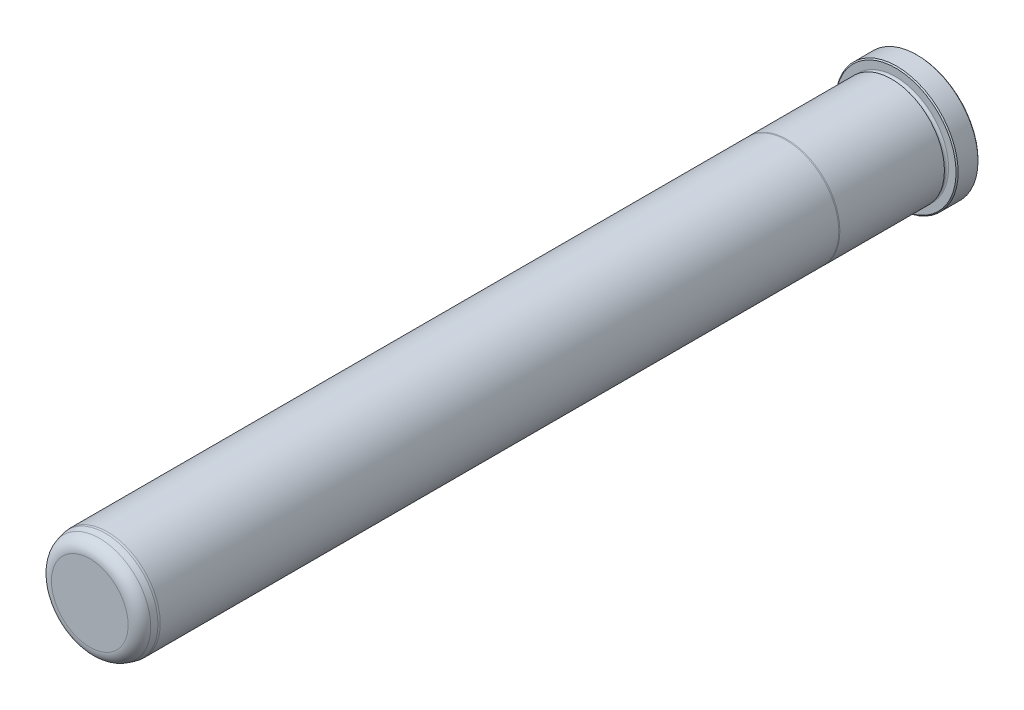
ISO-10303-21;
HEADER;
FILE_DESCRIPTION(('STEP AP214'),'2;1');
FILE_NAME('part.step','',(''),(''),'','','');
FILE_SCHEMA(('AUTOMOTIVE_DESIGN { 1 0 10303 214 1 1 1 1 }'));
ENDSEC;
DATA;
#1=APPLICATION_CONTEXT('core data for automotive mechanical design processes');
#2=APPLICATION_PROTOCOL_DEFINITION('international standard','automotive_design',2000,#1);
#3=PRODUCT_CONTEXT('',#1,'mechanical');
#4=PRODUCT('Part','Part','',(#3));
#5=PRODUCT_RELATED_PRODUCT_CATEGORY('part','',(#4));
#6=PRODUCT_DEFINITION_FORMATION('','',#4);
#7=PRODUCT_DEFINITION_CONTEXT('part definition',#1,'design');
#8=PRODUCT_DEFINITION('design','',#6,#7);
#9=PRODUCT_DEFINITION_SHAPE('','',#8);
#10=(LENGTH_UNIT() NAMED_UNIT(*) SI_UNIT(.MILLI.,.METRE.));
#11=(NAMED_UNIT(*) PLANE_ANGLE_UNIT() SI_UNIT($,.RADIAN.));
#12=(NAMED_UNIT(*) SI_UNIT($,.STERADIAN.) SOLID_ANGLE_UNIT());
#13=UNCERTAINTY_MEASURE_WITH_UNIT(LENGTH_MEASURE(1.E-05),#10,'distance_accuracy_value','');
#14=(GEOMETRIC_REPRESENTATION_CONTEXT(3) GLOBAL_UNCERTAINTY_ASSIGNED_CONTEXT((#13)) GLOBAL_UNIT_ASSIGNED_CONTEXT((#10,
#11,#12)) REPRESENTATION_CONTEXT('',''));
#15=CARTESIAN_POINT('',(0.,0.,0.));
#16=DIRECTION('',(0.,0.,1.));
#17=DIRECTION('',(1.,0.,0.));
#18=AXIS2_PLACEMENT_3D('',#15,#16,#17);
#19=CARTESIAN_POINT('',(0.,0.,0.));
#20=DIRECTION('',(0.,0.,1.));
#21=DIRECTION('',(1.,0.,0.));
#22=AXIS2_PLACEMENT_3D('',#19,#20,#21);
#23=PLANE('',#22);
#24=CARTESIAN_POINT('',(0.,0.,0.));
#25=DIRECTION('',(0.,0.,1.));
#26=DIRECTION('',(1.,0.,0.));
#27=AXIS2_PLACEMENT_3D('',#24,#25,#26);
#28=CIRCLE('',#27,21.717);
#29=CARTESIAN_POINT('',(21.717,0.,0.));
#30=VERTEX_POINT('',#29);
#31=EDGE_CURVE('E37',#30,#30,#28,.F.);
#32=ORIENTED_EDGE('',*,*,#31,.T.);
#33=EDGE_LOOP('',(#32));
#34=FACE_BOUND('',#33,.T.);
#35=ADVANCED_FACE('F30',(#34),#23,.F.);
#36=CARTESIAN_POINT('',(0.,0.,0.));
#37=DIRECTION('',(0.,0.,1.));
#38=DIRECTION('',(1.,0.,0.));
#39=AXIS2_PLACEMENT_3D('',#36,#37,#38);
#40=CYLINDRICAL_SURFACE('',#39,22.098);
#41=CARTESIAN_POINT('',(0.,0.,0.380999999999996));
#42=DIRECTION('',(0.,0.,1.));
#43=DIRECTION('',(1.,0.,0.));
#44=AXIS2_PLACEMENT_3D('',#41,#42,#43);
#45=CIRCLE('',#44,22.098);
#46=CARTESIAN_POINT('',(22.098,0.,0.380999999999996));
#47=VERTEX_POINT('',#46);
#48=EDGE_CURVE('E41',#47,#47,#45,.T.);
#49=ORIENTED_EDGE('',*,*,#48,.T.);
#50=EDGE_LOOP('',(#49));
#51=FACE_BOUND('',#50,.T.);
#52=CARTESIAN_POINT('',(0.,0.,7.54379999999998));
#53=DIRECTION('',(0.,0.,-1.));
#54=DIRECTION('',(-1.,0.,0.));
#55=AXIS2_PLACEMENT_3D('',#52,#53,#54);
#56=CIRCLE('',#55,22.098);
#57=CARTESIAN_POINT('',(-22.098,0.,7.54379999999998));
#58=VERTEX_POINT('',#57);
#59=EDGE_CURVE('E45',#58,#58,#56,.T.);
#60=ORIENTED_EDGE('',*,*,#59,.T.);
#61=EDGE_LOOP('',(#60));
#62=FACE_BOUND('',#61,.T.);
#63=ADVANCED_FACE('F118',(#51,#62),#40,.T.);
#64=CARTESIAN_POINT('',(0.,22.098,7.9248));
#65=DIRECTION('',(0.,0.,-1.));
#66=DIRECTION('',(-1.,0.,0.));
#67=AXIS2_PLACEMENT_3D('',#64,#65,#66);
#68=PLANE('',#67);
#69=CARTESIAN_POINT('',(0.,0.,7.9248));
#70=DIRECTION('',(0.,0.,-1.));
#71=DIRECTION('',(-1.,0.,0.));
#72=AXIS2_PLACEMENT_3D('',#69,#70,#71);
#73=CIRCLE('',#72,21.717);
#74=CARTESIAN_POINT('',(-21.717,0.,7.9248));
#75=VERTEX_POINT('',#74);
#76=EDGE_CURVE('E10',#75,#75,#73,.F.);
#77=ORIENTED_EDGE('',*,*,#76,.T.);
#78=EDGE_LOOP('',(#77));
#79=FACE_BOUND('',#78,.T.);
#80=CARTESIAN_POINT('',(0.,0.,7.9248));
#81=DIRECTION('',(0.,0.,1.));
#82=DIRECTION('',(1.,0.,0.));
#83=AXIS2_PLACEMENT_3D('',#80,#81,#82);
#84=CIRCLE('',#83,19.0373);
#85=CARTESIAN_POINT('',(19.0373,0.,7.9248));
#86=VERTEX_POINT('',#85);
#87=EDGE_CURVE('E56',#86,#86,#84,.T.);
#88=ORIENTED_EDGE('',*,*,#87,.F.);
#89=EDGE_LOOP('',(#88));
#90=FACE_BOUND('',#89,.T.);
#91=ADVANCED_FACE('F113',(#79,#90),#68,.F.);
#92=CARTESIAN_POINT('',(0.,0.,8.6868));
#93=DIRECTION('',(0.,0.,1.));
#94=DIRECTION('',(1.,0.,0.));
#95=AXIS2_PLACEMENT_3D('',#92,#93,#94);
#96=TOROIDAL_SURFACE('',#95,19.0373,0.762);
#97=CARTESIAN_POINT('',(0.,0.,9.4488));
#98=DIRECTION('',(0.,0.,1.));
#99=DIRECTION('',(1.,0.,0.));
#100=AXIS2_PLACEMENT_3D('',#97,#98,#99);
#101=CIRCLE('',#100,19.0373);
#102=CARTESIAN_POINT('',(19.0373,0.,9.4488));
#103=VERTEX_POINT('',#102);
#104=EDGE_CURVE('E59',#103,#103,#101,.T.);
#105=ORIENTED_EDGE('',*,*,#104,.F.);
#106=EDGE_LOOP('',(#105));
#107=FACE_BOUND('',#106,.T.);
#108=ORIENTED_EDGE('',*,*,#87,.T.);
#109=EDGE_LOOP('',(#108));
#110=FACE_BOUND('',#109,.T.);
#111=ADVANCED_FACE('F107',(#107,#110),#96,.F.);
#112=CARTESIAN_POINT('',(0.,19.0373,9.4488));
#113=DIRECTION('',(0.,0.,1.));
#114=DIRECTION('',(1.,0.,0.));
#115=AXIS2_PLACEMENT_3D('',#112,#113,#114);
#116=PLANE('',#115);
#117=CARTESIAN_POINT('',(0.,0.,9.4488));
#118=DIRECTION('',(0.,0.,1.));
#119=DIRECTION('',(1.,0.,0.));
#120=AXIS2_PLACEMENT_3D('',#117,#118,#119);
#121=CIRCLE('',#120,19.0627);
#122=CARTESIAN_POINT('',(19.0627,0.,9.4488));
#123=VERTEX_POINT('',#122);
#124=EDGE_CURVE('E62',#123,#123,#121,.T.);
#125=ORIENTED_EDGE('',*,*,#124,.F.);
#126=EDGE_LOOP('',(#125));
#127=FACE_BOUND('',#126,.T.);
#128=ORIENTED_EDGE('',*,*,#104,.T.);
#129=EDGE_LOOP('',(#128));
#130=FACE_BOUND('',#129,.T.);
#131=ADVANCED_FACE('F101',(#127,#130),#116,.F.);
#132=CARTESIAN_POINT('',(0.,0.,0.));
#133=DIRECTION('',(0.,0.,1.));
#134=DIRECTION('',(1.,0.,0.));
#135=AXIS2_PLACEMENT_3D('',#132,#133,#134);
#136=CYLINDRICAL_SURFACE('',#135,19.0627);
#137=CARTESIAN_POINT('',(0.,0.,47.1347630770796));
#138=DIRECTION('',(0.,0.,1.));
#139=DIRECTION('',(1.,0.,0.));
#140=AXIS2_PLACEMENT_3D('',#137,#138,#139);
#141=CIRCLE('',#140,19.0627);
#142=CARTESIAN_POINT('',(19.0627,0.,47.1347630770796));
#143=VERTEX_POINT('',#142);
#144=EDGE_CURVE('E65',#143,#143,#141,.T.);
#145=ORIENTED_EDGE('',*,*,#144,.F.);
#146=EDGE_LOOP('',(#145));
#147=FACE_BOUND('',#146,.T.);
#148=ORIENTED_EDGE('',*,*,#124,.T.);
#149=EDGE_LOOP('',(#148));
#150=FACE_BOUND('',#149,.T.);
#151=ADVANCED_FACE('F95',(#147,#150),#136,.T.);
#152=CARTESIAN_POINT('',(0.,0.,47.1347630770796));
#153=DIRECTION('',(0.,0.,-1.));
#154=DIRECTION('',(-1.,0.,0.));
#155=AXIS2_PLACEMENT_3D('',#152,#153,#154);
#156=CONICAL_SURFACE('',#155,19.0627,0.0698131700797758);
#157=CARTESIAN_POINT('',(0.,0.,47.498));
#158=DIRECTION('',(0.,0.,1.));
#159=DIRECTION('',(1.,0.,0.));
#160=AXIS2_PLACEMENT_3D('',#157,#158,#159);
#161=CIRCLE('',#160,19.0373);
#162=CARTESIAN_POINT('',(19.0373,0.,47.498));
#163=VERTEX_POINT('',#162);
#164=EDGE_CURVE('E68',#163,#163,#161,.T.);
#165=ORIENTED_EDGE('',*,*,#164,.F.);
#166=EDGE_LOOP('',(#165));
#167=FACE_BOUND('',#166,.T.);
#168=ORIENTED_EDGE('',*,*,#144,.T.);
#169=EDGE_LOOP('',(#168));
#170=FACE_BOUND('',#169,.T.);
#171=ADVANCED_FACE('F89',(#167,#170),#156,.T.);
#172=CARTESIAN_POINT('',(0.,0.,0.));
#173=DIRECTION('',(0.,0.,1.));
#174=DIRECTION('',(1.,0.,0.));
#175=AXIS2_PLACEMENT_3D('',#172,#173,#174);
#176=CYLINDRICAL_SURFACE('',#175,19.0373);
#177=CARTESIAN_POINT('',(0.,0.,292.1));
#178=DIRECTION('',(0.,0.,1.));
#179=DIRECTION('',(1.,0.,0.));
#180=AXIS2_PLACEMENT_3D('',#177,#178,#179);
#181=CIRCLE('',#180,19.0373);
#182=CARTESIAN_POINT('',(19.0373,0.,292.1));
#183=VERTEX_POINT('',#182);
#184=EDGE_CURVE('E71',#183,#183,#181,.T.);
#185=ORIENTED_EDGE('',*,*,#184,.F.);
#186=EDGE_LOOP('',(#185));
#187=FACE_BOUND('',#186,.T.);
#188=ORIENTED_EDGE('',*,*,#164,.T.);
#189=EDGE_LOOP('',(#188));
#190=FACE_BOUND('',#189,.T.);
#191=ADVANCED_FACE('F83',(#187,#190),#176,.T.);
#192=CARTESIAN_POINT('',(0.,0.,292.1));
#193=DIRECTION('',(0.,0.,-1.));
#194=DIRECTION('',(-1.,0.,0.));
#195=AXIS2_PLACEMENT_3D('',#192,#193,#194);
#196=CONICAL_SURFACE('',#195,19.0373,0.0872664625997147);
#197=CARTESIAN_POINT('',(0.,0.,292.862));
#198=DIRECTION('',(0.,0.,1.));
#199=DIRECTION('',(1.,0.,0.));
#200=AXIS2_PLACEMENT_3D('',#197,#198,#199);
#201=CIRCLE('',#200,18.9706336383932);
#202=CARTESIAN_POINT('',(18.9706336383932,0.,292.862));
#203=VERTEX_POINT('',#202);
#204=EDGE_CURVE('E74',#203,#203,#201,.T.);
#205=ORIENTED_EDGE('',*,*,#204,.F.);
#206=EDGE_LOOP('',(#205));
#207=FACE_BOUND('',#206,.T.);
#208=ORIENTED_EDGE('',*,*,#184,.T.);
#209=EDGE_LOOP('',(#208));
#210=FACE_BOUND('',#209,.T.);
#211=ADVANCED_FACE('F80',(#207,#210),#196,.T.);
#212=CARTESIAN_POINT('',(0.,0.,292.862));
#213=DIRECTION('',(0.,0.,-1.));
#214=DIRECTION('',(-1.,0.,0.));
#215=AXIS2_PLACEMENT_3D('',#212,#213,#214);
#216=CONICAL_SURFACE('',#215,18.9706336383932,0.26179938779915);
#217=CARTESIAN_POINT('',(0.,0.,294.920125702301));
#218=DIRECTION('',(0.,0.,1.));
#219=DIRECTION('',(1.,0.,0.));
#220=AXIS2_PLACEMENT_3D('',#217,#218,#219);
#221=CIRCLE('',#220,18.41916051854);
#222=CARTESIAN_POINT('',(18.41916051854,0.,294.920125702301));
#223=VERTEX_POINT('',#222);
#224=EDGE_CURVE('E50',#223,#223,#221,.F.);
#225=ORIENTED_EDGE('',*,*,#224,.T.);
#226=EDGE_LOOP('',(#225));
#227=FACE_BOUND('',#226,.T.);
#228=ORIENTED_EDGE('',*,*,#204,.T.);
#229=EDGE_LOOP('',(#228));
#230=FACE_BOUND('',#229,.T.);
#231=ADVANCED_FACE('F78',(#227,#230),#216,.T.);
#232=CARTESIAN_POINT('',(0.,17.4733335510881,298.45));
#233=DIRECTION('',(0.,0.,-1.));
#234=DIRECTION('',(-1.,0.,0.));
#235=AXIS2_PLACEMENT_3D('',#232,#233,#234);
#236=PLANE('',#235);
#237=CARTESIAN_POINT('',(0.,0.,298.45));
#238=DIRECTION('',(0.,0.,-1.));
#239=DIRECTION('',(-1.,0.,0.));
#240=AXIS2_PLACEMENT_3D('',#237,#238,#239);
#241=CIRCLE('',#240,13.8189387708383);
#242=CARTESIAN_POINT('',(-13.8189387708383,0.,298.45));
#243=VERTEX_POINT('',#242);
#244=EDGE_CURVE('E53',#243,#243,#241,.F.);
#245=ORIENTED_EDGE('',*,*,#244,.T.);
#246=EDGE_LOOP('',(#245));
#247=FACE_BOUND('',#246,.T.);
#248=ADVANCED_FACE('F133',(#247),#236,.F.);
#249=CARTESIAN_POINT('',(0.,0.,293.6875));
#250=DIRECTION('',(0.,0.,-1.));
#251=DIRECTION('',(-1.,0.,0.));
#252=AXIS2_PLACEMENT_3D('',#249,#250,#251);
#253=TOROIDAL_SURFACE('',#252,13.8189387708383,4.7625);
#254=ORIENTED_EDGE('',*,*,#224,.F.);
#255=EDGE_LOOP('',(#254));
#256=FACE_BOUND('',#255,.T.);
#257=ORIENTED_EDGE('',*,*,#244,.F.);
#258=EDGE_LOOP('',(#257));
#259=FACE_BOUND('',#258,.T.);
#260=ADVANCED_FACE('F130',(#256,#259),#253,.T.);
#261=CARTESIAN_POINT('',(0.,0.,0.380999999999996));
#262=DIRECTION('',(0.,0.,1.));
#263=DIRECTION('',(1.,0.,0.));
#264=AXIS2_PLACEMENT_3D('',#261,#262,#263);
#265=CONICAL_SURFACE('',#264,22.098,0.785398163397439);
#266=ORIENTED_EDGE('',*,*,#31,.F.);
#267=EDGE_LOOP('',(#266));
#268=FACE_BOUND('',#267,.T.);
#269=ORIENTED_EDGE('',*,*,#48,.F.);
#270=EDGE_LOOP('',(#269));
#271=FACE_BOUND('',#270,.T.);
#272=ADVANCED_FACE('F132',(#268,#271),#265,.T.);
#273=CARTESIAN_POINT('',(0.,0.,7.9248));
#274=DIRECTION('',(0.,0.,-1.));
#275=DIRECTION('',(-1.,0.,0.));
#276=AXIS2_PLACEMENT_3D('',#273,#274,#275);
#277=CONICAL_SURFACE('',#276,21.717,0.785398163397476);
#278=ORIENTED_EDGE('',*,*,#59,.F.);
#279=EDGE_LOOP('',(#278));
#280=FACE_BOUND('',#279,.T.);
#281=ORIENTED_EDGE('',*,*,#76,.F.);
#282=EDGE_LOOP('',(#281));
#283=FACE_BOUND('',#282,.T.);
#284=ADVANCED_FACE('F32',(#280,#283),#277,.T.);
#285=CLOSED_SHELL('',(#35,#63,#91,#111,#131,#151,#171,#191,#211,#231,#248,#260,#272,#284));
#286=MANIFOLD_SOLID_BREP('B2',#285);
#287=ADVANCED_BREP_SHAPE_REPRESENTATION('',(#18,#286),#14);
#288=SHAPE_DEFINITION_REPRESENTATION(#9,#287);
ENDSEC;
END-ISO-10303-21;
